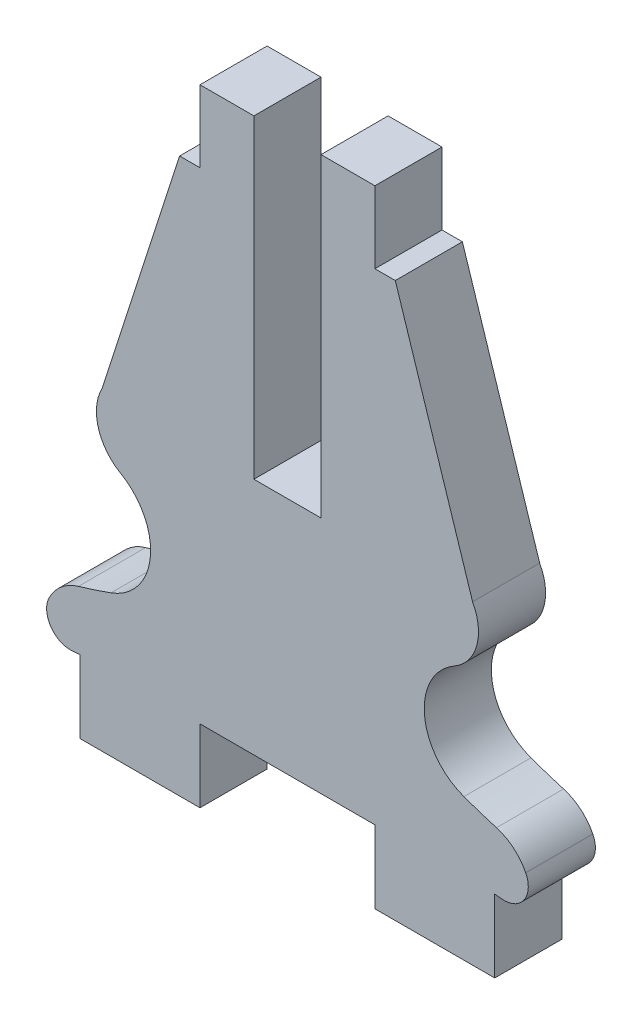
ISO-10303-21;
HEADER;
FILE_DESCRIPTION(('STEP AP214'),'2;1');
FILE_NAME('part.step','',(''),(''),'','','');
FILE_SCHEMA(('AUTOMOTIVE_DESIGN { 1 0 10303 214 1 1 1 1 }'));
ENDSEC;
DATA;
#1=APPLICATION_CONTEXT('core data for automotive mechanical design processes');
#2=APPLICATION_PROTOCOL_DEFINITION('international standard','automotive_design',2000,#1);
#3=PRODUCT_CONTEXT('',#1,'mechanical');
#4=PRODUCT('Part','Part','',(#3));
#5=PRODUCT_RELATED_PRODUCT_CATEGORY('part','',(#4));
#6=PRODUCT_DEFINITION_FORMATION('','',#4);
#7=PRODUCT_DEFINITION_CONTEXT('part definition',#1,'design');
#8=PRODUCT_DEFINITION('design','',#6,#7);
#9=PRODUCT_DEFINITION_SHAPE('','',#8);
#10=(LENGTH_UNIT() NAMED_UNIT(*) SI_UNIT(.MILLI.,.METRE.));
#11=(NAMED_UNIT(*) PLANE_ANGLE_UNIT() SI_UNIT($,.RADIAN.));
#12=(NAMED_UNIT(*) SI_UNIT($,.STERADIAN.) SOLID_ANGLE_UNIT());
#13=UNCERTAINTY_MEASURE_WITH_UNIT(LENGTH_MEASURE(1.E-05),#10,'distance_accuracy_value','');
#14=(GEOMETRIC_REPRESENTATION_CONTEXT(3) GLOBAL_UNCERTAINTY_ASSIGNED_CONTEXT((#13)) GLOBAL_UNIT_ASSIGNED_CONTEXT((#10,
#11,#12)) REPRESENTATION_CONTEXT('',''));
#15=CARTESIAN_POINT('',(0.,0.,0.));
#16=DIRECTION('',(0.,0.,1.));
#17=DIRECTION('',(1.,0.,0.));
#18=AXIS2_PLACEMENT_3D('',#15,#16,#17);
#19=CARTESIAN_POINT('',(-3.65,-3.,2.8));
#20=DIRECTION('',(0.,1.,0.));
#21=DIRECTION('',(0.,0.,1.));
#22=AXIS2_PLACEMENT_3D('',#19,#20,#21);
#23=PLANE('',#22);
#24=DIRECTION('',(1.,0.,0.));
#25=VECTOR('',#24,1.);
#26=CARTESIAN_POINT('',(-3.65,-3.,0.));
#27=LINE('',#26,#25);
#28=CARTESIAN_POINT('',(-8.65,-3.,0.));
#29=VERTEX_POINT('',#28);
#30=CARTESIAN_POINT('',(-3.65,-3.,0.));
#31=VERTEX_POINT('',#30);
#32=EDGE_CURVE('E276',#29,#31,#27,.T.);
#33=ORIENTED_EDGE('',*,*,#32,.T.);
#34=DIRECTION('',(0.,0.,-1.));
#35=VECTOR('',#34,1.);
#36=CARTESIAN_POINT('',(-3.65,-3.,2.8));
#37=LINE('',#36,#35);
#38=CARTESIAN_POINT('',(-3.65,-3.,2.8));
#39=VERTEX_POINT('',#38);
#40=EDGE_CURVE('E11',#39,#31,#37,.T.);
#41=ORIENTED_EDGE('',*,*,#40,.F.);
#42=DIRECTION('',(1.,0.,0.));
#43=VECTOR('',#42,1.);
#44=CARTESIAN_POINT('',(-3.65,-3.,2.8));
#45=LINE('',#44,#43);
#46=CARTESIAN_POINT('',(-8.65,-3.,2.8));
#47=VERTEX_POINT('',#46);
#48=EDGE_CURVE('E364',#47,#39,#45,.T.);
#49=ORIENTED_EDGE('',*,*,#48,.F.);
#50=DIRECTION('',(0.,0.,-1.));
#51=VECTOR('',#50,1.);
#52=CARTESIAN_POINT('',(-8.65,-3.,2.8));
#53=LINE('',#52,#51);
#54=EDGE_CURVE('E272',#47,#29,#53,.T.);
#55=ORIENTED_EDGE('',*,*,#54,.T.);
#56=EDGE_LOOP('',(#33,#41,#49,#55));
#57=FACE_BOUND('',#56,.T.);
#58=ADVANCED_FACE('F43',(#57),#23,.F.);
#59=CARTESIAN_POINT('',(-3.65,0.0356349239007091,2.8));
#60=DIRECTION('',(-1.,0.,0.));
#61=DIRECTION('',(0.,-1.,0.));
#62=AXIS2_PLACEMENT_3D('',#59,#60,#61);
#63=PLANE('',#62);
#64=DIRECTION('',(0.,1.,0.));
#65=VECTOR('',#64,1.);
#66=CARTESIAN_POINT('',(-3.65,0.0356349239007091,0.));
#67=LINE('',#66,#65);
#68=CARTESIAN_POINT('',(-3.65,0.0356349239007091,0.));
#69=VERTEX_POINT('',#68);
#70=EDGE_CURVE('E280',#31,#69,#67,.T.);
#71=ORIENTED_EDGE('',*,*,#70,.T.);
#72=DIRECTION('',(0.,0.,-1.));
#73=VECTOR('',#72,1.);
#74=CARTESIAN_POINT('',(-3.65,0.0356349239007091,2.8));
#75=LINE('',#74,#73);
#76=CARTESIAN_POINT('',(-3.65,0.0356349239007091,2.8));
#77=VERTEX_POINT('',#76);
#78=EDGE_CURVE('E52',#77,#69,#75,.T.);
#79=ORIENTED_EDGE('',*,*,#78,.F.);
#80=DIRECTION('',(0.,1.,0.));
#81=VECTOR('',#80,1.);
#82=CARTESIAN_POINT('',(-3.65,0.0356349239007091,2.8));
#83=LINE('',#82,#81);
#84=EDGE_CURVE('E169',#39,#77,#83,.T.);
#85=ORIENTED_EDGE('',*,*,#84,.F.);
#86=ORIENTED_EDGE('',*,*,#40,.T.);
#87=EDGE_LOOP('',(#71,#79,#85,#86));
#88=FACE_BOUND('',#87,.T.);
#89=ADVANCED_FACE('F584',(#88),#63,.F.);
#90=CARTESIAN_POINT('',(-3.65,0.0356349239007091,2.8));
#91=DIRECTION('',(0.,1.,0.));
#92=DIRECTION('',(0.,0.,1.));
#93=AXIS2_PLACEMENT_3D('',#90,#91,#92);
#94=PLANE('',#93);
#95=DIRECTION('',(1.,0.,0.));
#96=VECTOR('',#95,1.);
#97=CARTESIAN_POINT('',(-3.65,0.0356349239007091,0.));
#98=LINE('',#97,#96);
#99=CARTESIAN_POINT('',(3.65,0.0356349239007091,0.));
#100=VERTEX_POINT('',#99);
#101=EDGE_CURVE('E283',#69,#100,#98,.T.);
#102=ORIENTED_EDGE('',*,*,#101,.T.);
#103=DIRECTION('',(0.,0.,-1.));
#104=VECTOR('',#103,1.);
#105=CARTESIAN_POINT('',(3.65,0.0356349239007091,2.8));
#106=LINE('',#105,#104);
#107=CARTESIAN_POINT('',(3.65,0.0356349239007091,2.8));
#108=VERTEX_POINT('',#107);
#109=EDGE_CURVE('E463',#108,#100,#106,.T.);
#110=ORIENTED_EDGE('',*,*,#109,.F.);
#111=DIRECTION('',(1.,0.,0.));
#112=VECTOR('',#111,1.);
#113=CARTESIAN_POINT('',(-3.65,0.0356349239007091,2.8));
#114=LINE('',#113,#112);
#115=EDGE_CURVE('E473',#77,#108,#114,.T.);
#116=ORIENTED_EDGE('',*,*,#115,.F.);
#117=ORIENTED_EDGE('',*,*,#78,.T.);
#118=EDGE_LOOP('',(#102,#110,#116,#117));
#119=FACE_BOUND('',#118,.T.);
#120=ADVANCED_FACE('F471',(#119),#94,.F.);
#121=CARTESIAN_POINT('',(3.65,0.0356349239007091,2.8));
#122=DIRECTION('',(1.,0.,0.));
#123=DIRECTION('',(0.,1.,0.));
#124=AXIS2_PLACEMENT_3D('',#121,#122,#123);
#125=PLANE('',#124);
#126=DIRECTION('',(0.,-1.,0.));
#127=VECTOR('',#126,1.);
#128=CARTESIAN_POINT('',(3.65,0.0356349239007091,0.));
#129=LINE('',#128,#127);
#130=CARTESIAN_POINT('',(3.65,-2.99999999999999,0.));
#131=VERTEX_POINT('',#130);
#132=EDGE_CURVE('E286',#100,#131,#129,.T.);
#133=ORIENTED_EDGE('',*,*,#132,.T.);
#134=DIRECTION('',(0.,0.,-1.));
#135=VECTOR('',#134,1.);
#136=CARTESIAN_POINT('',(3.65,-2.99999999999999,2.8));
#137=LINE('',#136,#135);
#138=CARTESIAN_POINT('',(3.65,-2.99999999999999,2.8));
#139=VERTEX_POINT('',#138);
#140=EDGE_CURVE('E459',#139,#131,#137,.T.);
#141=ORIENTED_EDGE('',*,*,#140,.F.);
#142=DIRECTION('',(0.,-1.,0.));
#143=VECTOR('',#142,1.);
#144=CARTESIAN_POINT('',(3.65,0.0356349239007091,2.8));
#145=LINE('',#144,#143);
#146=EDGE_CURVE('E492',#108,#139,#145,.T.);
#147=ORIENTED_EDGE('',*,*,#146,.F.);
#148=ORIENTED_EDGE('',*,*,#109,.T.);
#149=EDGE_LOOP('',(#133,#141,#147,#148));
#150=FACE_BOUND('',#149,.T.);
#151=ADVANCED_FACE('F482',(#150),#125,.F.);
#152=CARTESIAN_POINT('',(3.65,-2.99999999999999,2.8));
#153=DIRECTION('',(0.,1.,0.));
#154=DIRECTION('',(-1.,0.,0.));
#155=AXIS2_PLACEMENT_3D('',#152,#153,#154);
#156=PLANE('',#155);
#157=DIRECTION('',(1.,0.,0.));
#158=VECTOR('',#157,1.);
#159=CARTESIAN_POINT('',(3.65,-2.99999999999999,0.));
#160=LINE('',#159,#158);
#161=CARTESIAN_POINT('',(8.65,-2.99999999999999,0.));
#162=VERTEX_POINT('',#161);
#163=EDGE_CURVE('E289',#131,#162,#160,.T.);
#164=ORIENTED_EDGE('',*,*,#163,.T.);
#165=DIRECTION('',(0.,0.,-1.));
#166=VECTOR('',#165,1.);
#167=CARTESIAN_POINT('',(8.65,-2.99999999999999,2.8));
#168=LINE('',#167,#166);
#169=CARTESIAN_POINT('',(8.65,-2.99999999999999,2.8));
#170=VERTEX_POINT('',#169);
#171=EDGE_CURVE('E455',#170,#162,#168,.T.);
#172=ORIENTED_EDGE('',*,*,#171,.F.);
#173=DIRECTION('',(1.,0.,0.));
#174=VECTOR('',#173,1.);
#175=CARTESIAN_POINT('',(3.65,-2.99999999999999,2.8));
#176=LINE('',#175,#174);
#177=EDGE_CURVE('E488',#139,#170,#176,.T.);
#178=ORIENTED_EDGE('',*,*,#177,.F.);
#179=ORIENTED_EDGE('',*,*,#140,.T.);
#180=EDGE_LOOP('',(#164,#172,#178,#179));
#181=FACE_BOUND('',#180,.T.);
#182=ADVANCED_FACE('F486',(#181),#156,.F.);
#183=CARTESIAN_POINT('',(8.65,-2.99999999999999,2.8));
#184=DIRECTION('',(-1.,0.,0.));
#185=DIRECTION('',(0.,-1.,0.));
#186=AXIS2_PLACEMENT_3D('',#183,#184,#185);
#187=PLANE('',#186);
#188=DIRECTION('',(0.,1.,0.));
#189=VECTOR('',#188,1.);
#190=CARTESIAN_POINT('',(8.65,-2.99999999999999,0.));
#191=LINE('',#190,#189);
#192=CARTESIAN_POINT('',(8.65,0.0356349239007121,0.));
#193=VERTEX_POINT('',#192);
#194=EDGE_CURVE('E292',#162,#193,#191,.T.);
#195=ORIENTED_EDGE('',*,*,#194,.T.);
#196=DIRECTION('',(0.,0.,-1.));
#197=VECTOR('',#196,1.);
#198=CARTESIAN_POINT('',(8.65,0.0356349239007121,2.8));
#199=LINE('',#198,#197);
#200=CARTESIAN_POINT('',(8.65,0.0356349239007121,2.8));
#201=VERTEX_POINT('',#200);
#202=EDGE_CURVE('E451',#201,#193,#199,.T.);
#203=ORIENTED_EDGE('',*,*,#202,.F.);
#204=DIRECTION('',(0.,1.,0.));
#205=VECTOR('',#204,1.);
#206=CARTESIAN_POINT('',(8.65,-2.99999999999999,2.8));
#207=LINE('',#206,#205);
#208=EDGE_CURVE('E491',#170,#201,#207,.T.);
#209=ORIENTED_EDGE('',*,*,#208,.F.);
#210=ORIENTED_EDGE('',*,*,#171,.T.);
#211=EDGE_LOOP('',(#195,#203,#209,#210));
#212=FACE_BOUND('',#211,.T.);
#213=ADVANCED_FACE('F597',(#212),#187,.F.);
#214=CARTESIAN_POINT('',(8.65,0.0356349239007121,2.8));
#215=DIRECTION('',(0.10155089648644,0.994830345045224,0.));
#216=DIRECTION('',(-0.994830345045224,0.10155089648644,0.));
#217=AXIS2_PLACEMENT_3D('',#214,#215,#216);
#218=PLANE('',#217);
#219=DIRECTION('',(0.994830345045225,-0.10155089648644,0.));
#220=VECTOR('',#219,1.);
#221=CARTESIAN_POINT('',(8.65,0.0356349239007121,0.));
#222=LINE('',#221,#220);
#223=CARTESIAN_POINT('',(8.94844910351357,0.00516965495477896,0.));
#224=VERTEX_POINT('',#223);
#225=EDGE_CURVE('E295',#193,#224,#222,.T.);
#226=ORIENTED_EDGE('',*,*,#225,.T.);
#227=DIRECTION('',(0.,0.,-1.));
#228=VECTOR('',#227,1.);
#229=CARTESIAN_POINT('',(8.94844910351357,0.00516965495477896,2.8));
#230=LINE('',#229,#228);
#231=CARTESIAN_POINT('',(8.94844910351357,0.00516965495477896,2.8));
#232=VERTEX_POINT('',#231);
#233=EDGE_CURVE('E447',#232,#224,#230,.T.);
#234=ORIENTED_EDGE('',*,*,#233,.F.);
#235=DIRECTION('',(0.994830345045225,-0.10155089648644,0.));
#236=VECTOR('',#235,1.);
#237=CARTESIAN_POINT('',(8.65,0.0356349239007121,2.8));
#238=LINE('',#237,#236);
#239=EDGE_CURVE('E496',#201,#232,#238,.T.);
#240=ORIENTED_EDGE('',*,*,#239,.F.);
#241=ORIENTED_EDGE('',*,*,#202,.T.);
#242=EDGE_LOOP('',(#226,#234,#240,#241));
#243=FACE_BOUND('',#242,.T.);
#244=ADVANCED_FACE('F600',(#243),#218,.F.);
#245=CARTESIAN_POINT('',(9.05,1.,2.8));
#246=DIRECTION('',(0.,0.,-1.));
#247=DIRECTION('',(-1.,0.,0.));
#248=AXIS2_PLACEMENT_3D('',#245,#246,#247);
#249=CYLINDRICAL_SURFACE('',#248,1.);
#250=CARTESIAN_POINT('',(9.05,1.,0.));
#251=DIRECTION('',(0.,0.,1.));
#252=DIRECTION('',(1.,0.,0.));
#253=AXIS2_PLACEMENT_3D('',#250,#251,#252);
#254=CIRCLE('',#253,1.);
#255=CARTESIAN_POINT('',(9.94310679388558,1.44984470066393,0.));
#256=VERTEX_POINT('',#255);
#257=EDGE_CURVE('E298',#224,#256,#254,.T.);
#258=ORIENTED_EDGE('',*,*,#257,.T.);
#259=DIRECTION('',(0.,0.,-1.));
#260=VECTOR('',#259,1.);
#261=CARTESIAN_POINT('',(9.94310679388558,1.44984470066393,2.8));
#262=LINE('',#261,#260);
#263=CARTESIAN_POINT('',(9.94310679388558,1.44984470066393,2.8));
#264=VERTEX_POINT('',#263);
#265=EDGE_CURVE('E443',#264,#256,#262,.T.);
#266=ORIENTED_EDGE('',*,*,#265,.F.);
#267=CARTESIAN_POINT('',(9.05,1.,2.8));
#268=DIRECTION('',(0.,0.,1.));
#269=DIRECTION('',(1.,0.,0.));
#270=AXIS2_PLACEMENT_3D('',#267,#268,#269);
#271=CIRCLE('',#270,1.);
#272=EDGE_CURVE('E503',#232,#264,#271,.T.);
#273=ORIENTED_EDGE('',*,*,#272,.F.);
#274=ORIENTED_EDGE('',*,*,#233,.T.);
#275=EDGE_LOOP('',(#258,#266,#273,#274));
#276=FACE_BOUND('',#275,.T.);
#277=ADVANCED_FACE('F604',(#276),#249,.T.);
#278=CARTESIAN_POINT('',(8.15689320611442,0.550155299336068,2.8));
#279=DIRECTION('',(0.,0.,-1.));
#280=DIRECTION('',(-1.,0.,0.));
#281=AXIS2_PLACEMENT_3D('',#278,#279,#280);
#282=CYLINDRICAL_SURFACE('',#281,2.);
#283=CARTESIAN_POINT('',(8.15689320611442,0.550155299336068,0.));
#284=DIRECTION('',(0.,0.,1.));
#285=DIRECTION('',(1.,0.,0.));
#286=AXIS2_PLACEMENT_3D('',#283,#284,#285);
#287=CIRCLE('',#286,2.);
#288=CARTESIAN_POINT('',(8.72257182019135,2.46848991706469,0.));
#289=VERTEX_POINT('',#288);
#290=EDGE_CURVE('E301',#256,#289,#287,.T.);
#291=ORIENTED_EDGE('',*,*,#290,.T.);
#292=DIRECTION('',(0.,0.,-1.));
#293=VECTOR('',#292,1.);
#294=CARTESIAN_POINT('',(8.72257182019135,2.46848991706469,2.8));
#295=LINE('',#294,#293);
#296=CARTESIAN_POINT('',(8.72257182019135,2.46848991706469,2.8));
#297=VERTEX_POINT('',#296);
#298=EDGE_CURVE('E439',#297,#289,#295,.T.);
#299=ORIENTED_EDGE('',*,*,#298,.F.);
#300=CARTESIAN_POINT('',(8.15689320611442,0.550155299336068,2.8));
#301=DIRECTION('',(0.,0.,1.));
#302=DIRECTION('',(1.,0.,0.));
#303=AXIS2_PLACEMENT_3D('',#300,#301,#302);
#304=CIRCLE('',#303,2.);
#305=EDGE_CURVE('E506',#264,#297,#304,.T.);
#306=ORIENTED_EDGE('',*,*,#305,.F.);
#307=ORIENTED_EDGE('',*,*,#265,.T.);
#308=EDGE_LOOP('',(#291,#299,#306,#307));
#309=FACE_BOUND('',#308,.T.);
#310=ADVANCED_FACE('F608',(#309),#282,.T.);
#311=CARTESIAN_POINT('',(15.6391267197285,25.9239757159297,2.8));
#312=DIRECTION('',(0.,0.,-1.));
#313=DIRECTION('',(-1.,0.,0.));
#314=AXIS2_PLACEMENT_3D('',#311,#312,#313);
#315=CYLINDRICAL_SURFACE('',#314,24.4540087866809);
#316=CARTESIAN_POINT('',(15.6391267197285,25.9239757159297,0.));
#317=DIRECTION('',(0.,0.,-1.));
#318=DIRECTION('',(-1.,0.,0.));
#319=AXIS2_PLACEMENT_3D('',#316,#317,#318);
#320=CIRCLE('',#319,24.4540087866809);
#321=CARTESIAN_POINT('',(7.36246639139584,2.91320781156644,0.));
#322=VERTEX_POINT('',#321);
#323=EDGE_CURVE('E304',#289,#322,#320,.T.);
#324=ORIENTED_EDGE('',*,*,#323,.T.);
#325=DIRECTION('',(0.,0.,-1.));
#326=VECTOR('',#325,1.);
#327=CARTESIAN_POINT('',(7.36246639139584,2.91320781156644,2.8));
#328=LINE('',#327,#326);
#329=CARTESIAN_POINT('',(7.36246639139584,2.91320781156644,2.8));
#330=VERTEX_POINT('',#329);
#331=EDGE_CURVE('E435',#330,#322,#328,.T.);
#332=ORIENTED_EDGE('',*,*,#331,.F.);
#333=CARTESIAN_POINT('',(15.6391267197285,25.9239757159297,2.8));
#334=DIRECTION('',(0.,0.,-1.));
#335=DIRECTION('',(-1.,0.,0.));
#336=AXIS2_PLACEMENT_3D('',#333,#334,#335);
#337=CIRCLE('',#336,24.4540087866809);
#338=EDGE_CURVE('E509',#297,#330,#337,.T.);
#339=ORIENTED_EDGE('',*,*,#338,.F.);
#340=ORIENTED_EDGE('',*,*,#298,.T.);
#341=EDGE_LOOP('',(#324,#332,#339,#340));
#342=FACE_BOUND('',#341,.T.);
#343=ADVANCED_FACE('F612',(#342),#315,.F.);
#344=CARTESIAN_POINT('',(8.20861194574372,5.26566136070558,2.8));
#345=DIRECTION('',(0.,0.,-1.));
#346=DIRECTION('',(-1.,0.,0.));
#347=AXIS2_PLACEMENT_3D('',#344,#345,#346);
#348=CYLINDRICAL_SURFACE('',#347,2.5);
#349=CARTESIAN_POINT('',(8.20861194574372,5.26566136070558,0.));
#350=DIRECTION('',(0.,0.,-1.));
#351=DIRECTION('',(-1.,0.,0.));
#352=AXIS2_PLACEMENT_3D('',#349,#350,#351);
#353=CIRCLE('',#352,2.5);
#354=CARTESIAN_POINT('',(6.96635920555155,7.43517930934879,0.));
#355=VERTEX_POINT('',#354);
#356=EDGE_CURVE('E307',#322,#355,#353,.T.);
#357=ORIENTED_EDGE('',*,*,#356,.T.);
#358=DIRECTION('',(0.,0.,-1.));
#359=VECTOR('',#358,1.);
#360=CARTESIAN_POINT('',(6.96635920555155,7.43517930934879,2.8));
#361=LINE('',#360,#359);
#362=CARTESIAN_POINT('',(6.96635920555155,7.43517930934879,2.8));
#363=VERTEX_POINT('',#362);
#364=EDGE_CURVE('E431',#363,#355,#361,.T.);
#365=ORIENTED_EDGE('',*,*,#364,.F.);
#366=CARTESIAN_POINT('',(8.20861194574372,5.26566136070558,2.8));
#367=DIRECTION('',(0.,0.,-1.));
#368=DIRECTION('',(-1.,0.,0.));
#369=AXIS2_PLACEMENT_3D('',#366,#367,#368);
#370=CIRCLE('',#369,2.5);
#371=EDGE_CURVE('E512',#330,#363,#370,.T.);
#372=ORIENTED_EDGE('',*,*,#371,.F.);
#373=ORIENTED_EDGE('',*,*,#331,.T.);
#374=EDGE_LOOP('',(#357,#365,#372,#373));
#375=FACE_BOUND('',#374,.T.);
#376=ADVANCED_FACE('F616',(#375),#348,.F.);
#377=CARTESIAN_POINT('',(5.97255701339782,9.17079366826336,2.8));
#378=DIRECTION('',(0.,0.,-1.));
#379=DIRECTION('',(-1.,0.,0.));
#380=AXIS2_PLACEMENT_3D('',#377,#378,#379);
#381=CYLINDRICAL_SURFACE('',#380,2.);
#382=CARTESIAN_POINT('',(5.97255701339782,9.17079366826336,0.));
#383=DIRECTION('',(0.,0.,1.));
#384=DIRECTION('',(1.,0.,0.));
#385=AXIS2_PLACEMENT_3D('',#382,#383,#384);
#386=CIRCLE('',#385,2.);
#387=CARTESIAN_POINT('',(7.72650027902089,10.1318779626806,0.));
#388=VERTEX_POINT('',#387);
#389=EDGE_CURVE('E310',#355,#388,#386,.T.);
#390=ORIENTED_EDGE('',*,*,#389,.T.);
#391=DIRECTION('',(0.,0.,-1.));
#392=VECTOR('',#391,1.);
#393=CARTESIAN_POINT('',(7.72650027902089,10.1318779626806,2.8));
#394=LINE('',#393,#392);
#395=CARTESIAN_POINT('',(7.72650027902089,10.1318779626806,2.8));
#396=VERTEX_POINT('',#395);
#397=EDGE_CURVE('E427',#396,#388,#394,.T.);
#398=ORIENTED_EDGE('',*,*,#397,.F.);
#399=CARTESIAN_POINT('',(5.97255701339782,9.17079366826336,2.8));
#400=DIRECTION('',(0.,0.,1.));
#401=DIRECTION('',(1.,0.,0.));
#402=AXIS2_PLACEMENT_3D('',#399,#400,#401);
#403=CIRCLE('',#402,2.);
#404=EDGE_CURVE('E515',#363,#396,#403,.T.);
#405=ORIENTED_EDGE('',*,*,#404,.F.);
#406=ORIENTED_EDGE('',*,*,#364,.T.);
#407=EDGE_LOOP('',(#390,#398,#405,#406));
#408=FACE_BOUND('',#407,.T.);
#409=ADVANCED_FACE('F620',(#408),#381,.T.);
#410=CARTESIAN_POINT('',(7.72650027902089,10.1318779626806,2.8));
#411=DIRECTION('',(-0.951689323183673,-0.307062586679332,0.));
#412=DIRECTION('',(0.307062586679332,-0.951689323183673,0.));
#413=AXIS2_PLACEMENT_3D('',#410,#411,#412);
#414=PLANE('',#413);
#415=DIRECTION('',(-0.307062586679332,0.951689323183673,0.));
#416=VECTOR('',#415,1.);
#417=CARTESIAN_POINT('',(7.72650027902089,10.1318779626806,0.));
#418=LINE('',#417,#416);
#419=CARTESIAN_POINT('',(4.5,20.1318779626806,0.));
#420=VERTEX_POINT('',#419);
#421=EDGE_CURVE('E313',#388,#420,#418,.T.);
#422=ORIENTED_EDGE('',*,*,#421,.T.);
#423=DIRECTION('',(0.,0.,-1.));
#424=VECTOR('',#423,1.);
#425=CARTESIAN_POINT('',(4.5,20.1318779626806,2.8));
#426=LINE('',#425,#424);
#427=CARTESIAN_POINT('',(4.5,20.1318779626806,2.8));
#428=VERTEX_POINT('',#427);
#429=EDGE_CURVE('E423',#428,#420,#426,.T.);
#430=ORIENTED_EDGE('',*,*,#429,.F.);
#431=DIRECTION('',(-0.307062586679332,0.951689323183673,0.));
#432=VECTOR('',#431,1.);
#433=CARTESIAN_POINT('',(7.72650027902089,10.1318779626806,2.8));
#434=LINE('',#433,#432);
#435=EDGE_CURVE('E518',#396,#428,#434,.T.);
#436=ORIENTED_EDGE('',*,*,#435,.F.);
#437=ORIENTED_EDGE('',*,*,#397,.T.);
#438=EDGE_LOOP('',(#422,#430,#436,#437));
#439=FACE_BOUND('',#438,.T.);
#440=ADVANCED_FACE('F624',(#439),#414,.F.);
#441=CARTESIAN_POINT('',(3.65,20.1318779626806,2.8));
#442=DIRECTION('',(0.,-1.,0.));
#443=DIRECTION('',(1.,0.,0.));
#444=AXIS2_PLACEMENT_3D('',#441,#442,#443);
#445=PLANE('',#444);
#446=DIRECTION('',(-1.,0.,0.));
#447=VECTOR('',#446,1.);
#448=CARTESIAN_POINT('',(3.65,20.1318779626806,0.));
#449=LINE('',#448,#447);
#450=CARTESIAN_POINT('',(3.65,20.1318779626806,0.));
#451=VERTEX_POINT('',#450);
#452=EDGE_CURVE('E316',#420,#451,#449,.T.);
#453=ORIENTED_EDGE('',*,*,#452,.T.);
#454=DIRECTION('',(0.,0.,-1.));
#455=VECTOR('',#454,1.);
#456=CARTESIAN_POINT('',(3.65,20.1318779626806,2.8));
#457=LINE('',#456,#455);
#458=CARTESIAN_POINT('',(3.65,20.1318779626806,2.8));
#459=VERTEX_POINT('',#458);
#460=EDGE_CURVE('E419',#459,#451,#457,.T.);
#461=ORIENTED_EDGE('',*,*,#460,.F.);
#462=DIRECTION('',(-1.,0.,0.));
#463=VECTOR('',#462,1.);
#464=CARTESIAN_POINT('',(3.65,20.1318779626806,2.8));
#465=LINE('',#464,#463);
#466=EDGE_CURVE('E521',#428,#459,#465,.T.);
#467=ORIENTED_EDGE('',*,*,#466,.F.);
#468=ORIENTED_EDGE('',*,*,#429,.T.);
#469=EDGE_LOOP('',(#453,#461,#467,#468));
#470=FACE_BOUND('',#469,.T.);
#471=ADVANCED_FACE('F628',(#470),#445,.F.);
#472=CARTESIAN_POINT('',(3.65,23.1318779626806,2.8));
#473=DIRECTION('',(-1.,0.,0.));
#474=DIRECTION('',(0.,-1.,0.));
#475=AXIS2_PLACEMENT_3D('',#472,#473,#474);
#476=PLANE('',#475);
#477=DIRECTION('',(0.,1.,0.));
#478=VECTOR('',#477,1.);
#479=CARTESIAN_POINT('',(3.65,23.1318779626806,0.));
#480=LINE('',#479,#478);
#481=CARTESIAN_POINT('',(3.65,23.1318779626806,0.));
#482=VERTEX_POINT('',#481);
#483=EDGE_CURVE('E319',#451,#482,#480,.T.);
#484=ORIENTED_EDGE('',*,*,#483,.T.);
#485=DIRECTION('',(0.,0.,-1.));
#486=VECTOR('',#485,1.);
#487=CARTESIAN_POINT('',(3.65,23.1318779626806,2.8));
#488=LINE('',#487,#486);
#489=CARTESIAN_POINT('',(3.65,23.1318779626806,2.8));
#490=VERTEX_POINT('',#489);
#491=EDGE_CURVE('E415',#490,#482,#488,.T.);
#492=ORIENTED_EDGE('',*,*,#491,.F.);
#493=DIRECTION('',(0.,1.,0.));
#494=VECTOR('',#493,1.);
#495=CARTESIAN_POINT('',(3.65,23.1318779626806,2.8));
#496=LINE('',#495,#494);
#497=EDGE_CURVE('E524',#459,#490,#496,.T.);
#498=ORIENTED_EDGE('',*,*,#497,.F.);
#499=ORIENTED_EDGE('',*,*,#460,.T.);
#500=EDGE_LOOP('',(#484,#492,#498,#499));
#501=FACE_BOUND('',#500,.T.);
#502=ADVANCED_FACE('F632',(#501),#476,.F.);
#503=CARTESIAN_POINT('',(1.4,23.1318779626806,2.8));
#504=DIRECTION('',(0.,-1.,0.));
#505=DIRECTION('',(0.,0.,-1.));
#506=AXIS2_PLACEMENT_3D('',#503,#504,#505);
#507=PLANE('',#506);
#508=DIRECTION('',(-1.,0.,0.));
#509=VECTOR('',#508,1.);
#510=CARTESIAN_POINT('',(1.4,23.1318779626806,0.));
#511=LINE('',#510,#509);
#512=CARTESIAN_POINT('',(1.4,23.1318779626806,0.));
#513=VERTEX_POINT('',#512);
#514=EDGE_CURVE('E322',#482,#513,#511,.T.);
#515=ORIENTED_EDGE('',*,*,#514,.T.);
#516=DIRECTION('',(0.,0.,-1.));
#517=VECTOR('',#516,1.);
#518=CARTESIAN_POINT('',(1.4,23.1318779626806,2.8));
#519=LINE('',#518,#517);
#520=CARTESIAN_POINT('',(1.4,23.1318779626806,2.8));
#521=VERTEX_POINT('',#520);
#522=EDGE_CURVE('E411',#521,#513,#519,.T.);
#523=ORIENTED_EDGE('',*,*,#522,.F.);
#524=DIRECTION('',(-1.,0.,0.));
#525=VECTOR('',#524,1.);
#526=CARTESIAN_POINT('',(1.4,23.1318779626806,2.8));
#527=LINE('',#526,#525);
#528=EDGE_CURVE('E527',#490,#521,#527,.T.);
#529=ORIENTED_EDGE('',*,*,#528,.F.);
#530=ORIENTED_EDGE('',*,*,#491,.T.);
#531=EDGE_LOOP('',(#515,#523,#529,#530));
#532=FACE_BOUND('',#531,.T.);
#533=ADVANCED_FACE('F636',(#532),#507,.F.);
#534=CARTESIAN_POINT('',(1.4,10.,2.8));
#535=DIRECTION('',(1.,0.,0.));
#536=DIRECTION('',(0.,0.,-1.));
#537=AXIS2_PLACEMENT_3D('',#534,#535,#536);
#538=PLANE('',#537);
#539=DIRECTION('',(0.,-1.,0.));
#540=VECTOR('',#539,1.);
#541=CARTESIAN_POINT('',(1.4,10.,0.));
#542=LINE('',#541,#540);
#543=CARTESIAN_POINT('',(1.4,10.,0.));
#544=VERTEX_POINT('',#543);
#545=EDGE_CURVE('E325',#513,#544,#542,.T.);
#546=ORIENTED_EDGE('',*,*,#545,.T.);
#547=DIRECTION('',(0.,0.,-1.));
#548=VECTOR('',#547,1.);
#549=CARTESIAN_POINT('',(1.4,10.,2.8));
#550=LINE('',#549,#548);
#551=CARTESIAN_POINT('',(1.4,10.,2.8));
#552=VERTEX_POINT('',#551);
#553=EDGE_CURVE('E407',#552,#544,#550,.T.);
#554=ORIENTED_EDGE('',*,*,#553,.F.);
#555=DIRECTION('',(0.,-1.,0.));
#556=VECTOR('',#555,1.);
#557=CARTESIAN_POINT('',(1.4,10.,2.8));
#558=LINE('',#557,#556);
#559=EDGE_CURVE('E530',#521,#552,#558,.T.);
#560=ORIENTED_EDGE('',*,*,#559,.F.);
#561=ORIENTED_EDGE('',*,*,#522,.T.);
#562=EDGE_LOOP('',(#546,#554,#560,#561));
#563=FACE_BOUND('',#562,.T.);
#564=ADVANCED_FACE('F640',(#563),#538,.F.);
#565=CARTESIAN_POINT('',(-1.4,10.,2.8));
#566=DIRECTION('',(0.,-1.,0.));
#567=DIRECTION('',(0.,0.,-1.));
#568=AXIS2_PLACEMENT_3D('',#565,#566,#567);
#569=PLANE('',#568);
#570=DIRECTION('',(-1.,0.,0.));
#571=VECTOR('',#570,1.);
#572=CARTESIAN_POINT('',(-1.4,10.,0.));
#573=LINE('',#572,#571);
#574=CARTESIAN_POINT('',(-1.4,10.,0.));
#575=VERTEX_POINT('',#574);
#576=EDGE_CURVE('E328',#544,#575,#573,.T.);
#577=ORIENTED_EDGE('',*,*,#576,.T.);
#578=DIRECTION('',(0.,0.,-1.));
#579=VECTOR('',#578,1.);
#580=CARTESIAN_POINT('',(-1.4,10.,2.8));
#581=LINE('',#580,#579);
#582=CARTESIAN_POINT('',(-1.4,10.,2.8));
#583=VERTEX_POINT('',#582);
#584=EDGE_CURVE('E403',#583,#575,#581,.T.);
#585=ORIENTED_EDGE('',*,*,#584,.F.);
#586=DIRECTION('',(-1.,0.,0.));
#587=VECTOR('',#586,1.);
#588=CARTESIAN_POINT('',(-1.4,10.,2.8));
#589=LINE('',#588,#587);
#590=EDGE_CURVE('E533',#552,#583,#589,.T.);
#591=ORIENTED_EDGE('',*,*,#590,.F.);
#592=ORIENTED_EDGE('',*,*,#553,.T.);
#593=EDGE_LOOP('',(#577,#585,#591,#592));
#594=FACE_BOUND('',#593,.T.);
#595=ADVANCED_FACE('F644',(#594),#569,.F.);
#596=CARTESIAN_POINT('',(-1.4,23.1318779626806,2.8));
#597=DIRECTION('',(-1.,0.,0.));
#598=DIRECTION('',(0.,0.,1.));
#599=AXIS2_PLACEMENT_3D('',#596,#597,#598);
#600=PLANE('',#599);
#601=DIRECTION('',(0.,1.,0.));
#602=VECTOR('',#601,1.);
#603=CARTESIAN_POINT('',(-1.4,23.1318779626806,0.));
#604=LINE('',#603,#602);
#605=CARTESIAN_POINT('',(-1.4,23.1318779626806,0.));
#606=VERTEX_POINT('',#605);
#607=EDGE_CURVE('E331',#575,#606,#604,.T.);
#608=ORIENTED_EDGE('',*,*,#607,.T.);
#609=DIRECTION('',(0.,0.,-1.));
#610=VECTOR('',#609,1.);
#611=CARTESIAN_POINT('',(-1.4,23.1318779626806,2.8));
#612=LINE('',#611,#610);
#613=CARTESIAN_POINT('',(-1.4,23.1318779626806,2.8));
#614=VERTEX_POINT('',#613);
#615=EDGE_CURVE('E399',#614,#606,#612,.T.);
#616=ORIENTED_EDGE('',*,*,#615,.F.);
#617=DIRECTION('',(0.,1.,0.));
#618=VECTOR('',#617,1.);
#619=CARTESIAN_POINT('',(-1.4,23.1318779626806,2.8));
#620=LINE('',#619,#618);
#621=EDGE_CURVE('E536',#583,#614,#620,.T.);
#622=ORIENTED_EDGE('',*,*,#621,.F.);
#623=ORIENTED_EDGE('',*,*,#584,.T.);
#624=EDGE_LOOP('',(#608,#616,#622,#623));
#625=FACE_BOUND('',#624,.T.);
#626=ADVANCED_FACE('F648',(#625),#600,.F.);
#627=CARTESIAN_POINT('',(-3.65,23.1318779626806,2.8));
#628=DIRECTION('',(0.,-1.,0.));
#629=DIRECTION('',(1.,0.,0.));
#630=AXIS2_PLACEMENT_3D('',#627,#628,#629);
#631=PLANE('',#630);
#632=DIRECTION('',(-1.,0.,0.));
#633=VECTOR('',#632,1.);
#634=CARTESIAN_POINT('',(-3.65,23.1318779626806,0.));
#635=LINE('',#634,#633);
#636=CARTESIAN_POINT('',(-3.65,23.1318779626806,0.));
#637=VERTEX_POINT('',#636);
#638=EDGE_CURVE('E334',#606,#637,#635,.T.);
#639=ORIENTED_EDGE('',*,*,#638,.T.);
#640=DIRECTION('',(0.,0.,-1.));
#641=VECTOR('',#640,1.);
#642=CARTESIAN_POINT('',(-3.65,23.1318779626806,2.8));
#643=LINE('',#642,#641);
#644=CARTESIAN_POINT('',(-3.65,23.1318779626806,2.8));
#645=VERTEX_POINT('',#644);
#646=EDGE_CURVE('E395',#645,#637,#643,.T.);
#647=ORIENTED_EDGE('',*,*,#646,.F.);
#648=DIRECTION('',(-1.,0.,0.));
#649=VECTOR('',#648,1.);
#650=CARTESIAN_POINT('',(-3.65,23.1318779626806,2.8));
#651=LINE('',#650,#649);
#652=EDGE_CURVE('E539',#614,#645,#651,.T.);
#653=ORIENTED_EDGE('',*,*,#652,.F.);
#654=ORIENTED_EDGE('',*,*,#615,.T.);
#655=EDGE_LOOP('',(#639,#647,#653,#654));
#656=FACE_BOUND('',#655,.T.);
#657=ADVANCED_FACE('F652',(#656),#631,.F.);
#658=CARTESIAN_POINT('',(-3.65,20.1318779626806,2.8));
#659=DIRECTION('',(1.,0.,0.));
#660=DIRECTION('',(0.,0.,-1.));
#661=AXIS2_PLACEMENT_3D('',#658,#659,#660);
#662=PLANE('',#661);
#663=DIRECTION('',(0.,-1.,0.));
#664=VECTOR('',#663,1.);
#665=CARTESIAN_POINT('',(-3.65,20.1318779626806,0.));
#666=LINE('',#665,#664);
#667=CARTESIAN_POINT('',(-3.65,20.1318779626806,0.));
#668=VERTEX_POINT('',#667);
#669=EDGE_CURVE('E337',#637,#668,#666,.T.);
#670=ORIENTED_EDGE('',*,*,#669,.T.);
#671=DIRECTION('',(0.,0.,-1.));
#672=VECTOR('',#671,1.);
#673=CARTESIAN_POINT('',(-3.65,20.1318779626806,2.8));
#674=LINE('',#673,#672);
#675=CARTESIAN_POINT('',(-3.65,20.1318779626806,2.8));
#676=VERTEX_POINT('',#675);
#677=EDGE_CURVE('E391',#676,#668,#674,.T.);
#678=ORIENTED_EDGE('',*,*,#677,.F.);
#679=DIRECTION('',(0.,-1.,0.));
#680=VECTOR('',#679,1.);
#681=CARTESIAN_POINT('',(-3.65,20.1318779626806,2.8));
#682=LINE('',#681,#680);
#683=EDGE_CURVE('E542',#645,#676,#682,.T.);
#684=ORIENTED_EDGE('',*,*,#683,.F.);
#685=ORIENTED_EDGE('',*,*,#646,.T.);
#686=EDGE_LOOP('',(#670,#678,#684,#685));
#687=FACE_BOUND('',#686,.T.);
#688=ADVANCED_FACE('F656',(#687),#662,.F.);
#689=CARTESIAN_POINT('',(-4.5,20.1318779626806,2.8));
#690=DIRECTION('',(0.,-1.,0.));
#691=DIRECTION('',(1.,0.,0.));
#692=AXIS2_PLACEMENT_3D('',#689,#690,#691);
#693=PLANE('',#692);
#694=DIRECTION('',(-1.,0.,0.));
#695=VECTOR('',#694,1.);
#696=CARTESIAN_POINT('',(-4.5,20.1318779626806,0.));
#697=LINE('',#696,#695);
#698=CARTESIAN_POINT('',(-4.5,20.1318779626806,0.));
#699=VERTEX_POINT('',#698);
#700=EDGE_CURVE('E340',#668,#699,#697,.T.);
#701=ORIENTED_EDGE('',*,*,#700,.T.);
#702=DIRECTION('',(0.,0.,-1.));
#703=VECTOR('',#702,1.);
#704=CARTESIAN_POINT('',(-4.5,20.1318779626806,2.8));
#705=LINE('',#704,#703);
#706=CARTESIAN_POINT('',(-4.5,20.1318779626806,2.8));
#707=VERTEX_POINT('',#706);
#708=EDGE_CURVE('E387',#707,#699,#705,.T.);
#709=ORIENTED_EDGE('',*,*,#708,.F.);
#710=DIRECTION('',(-1.,0.,0.));
#711=VECTOR('',#710,1.);
#712=CARTESIAN_POINT('',(-4.5,20.1318779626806,2.8));
#713=LINE('',#712,#711);
#714=EDGE_CURVE('E545',#676,#707,#713,.T.);
#715=ORIENTED_EDGE('',*,*,#714,.F.);
#716=ORIENTED_EDGE('',*,*,#677,.T.);
#717=EDGE_LOOP('',(#701,#709,#715,#716));
#718=FACE_BOUND('',#717,.T.);
#719=ADVANCED_FACE('F660',(#718),#693,.F.);
#720=CARTESIAN_POINT('',(-7.72650027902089,10.1318779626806,2.8));
#721=DIRECTION('',(0.951689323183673,-0.307062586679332,0.));
#722=DIRECTION('',(0.307062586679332,0.951689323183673,0.));
#723=AXIS2_PLACEMENT_3D('',#720,#721,#722);
#724=PLANE('',#723);
#725=DIRECTION('',(-0.307062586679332,-0.951689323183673,0.));
#726=VECTOR('',#725,1.);
#727=CARTESIAN_POINT('',(-7.72650027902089,10.1318779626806,0.));
#728=LINE('',#727,#726);
#729=CARTESIAN_POINT('',(-7.72650027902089,10.1318779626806,0.));
#730=VERTEX_POINT('',#729);
#731=EDGE_CURVE('E343',#699,#730,#728,.T.);
#732=ORIENTED_EDGE('',*,*,#731,.T.);
#733=DIRECTION('',(0.,0.,-1.));
#734=VECTOR('',#733,1.);
#735=CARTESIAN_POINT('',(-7.72650027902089,10.1318779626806,2.8));
#736=LINE('',#735,#734);
#737=CARTESIAN_POINT('',(-7.72650027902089,10.1318779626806,2.8));
#738=VERTEX_POINT('',#737);
#739=EDGE_CURVE('E383',#738,#730,#736,.T.);
#740=ORIENTED_EDGE('',*,*,#739,.F.);
#741=DIRECTION('',(-0.307062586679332,-0.951689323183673,0.));
#742=VECTOR('',#741,1.);
#743=CARTESIAN_POINT('',(-7.72650027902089,10.1318779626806,2.8));
#744=LINE('',#743,#742);
#745=EDGE_CURVE('E548',#707,#738,#744,.T.);
#746=ORIENTED_EDGE('',*,*,#745,.F.);
#747=ORIENTED_EDGE('',*,*,#708,.T.);
#748=EDGE_LOOP('',(#732,#740,#746,#747));
#749=FACE_BOUND('',#748,.T.);
#750=ADVANCED_FACE('F664',(#749),#724,.F.);
#751=CARTESIAN_POINT('',(-5.97255701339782,9.17079366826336,2.8));
#752=DIRECTION('',(0.,0.,-1.));
#753=DIRECTION('',(-1.,0.,0.));
#754=AXIS2_PLACEMENT_3D('',#751,#752,#753);
#755=CYLINDRICAL_SURFACE('',#754,2.);
#756=CARTESIAN_POINT('',(-5.97255701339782,9.17079366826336,0.));
#757=DIRECTION('',(0.,0.,1.));
#758=DIRECTION('',(-1.,0.,0.));
#759=AXIS2_PLACEMENT_3D('',#756,#757,#758);
#760=CIRCLE('',#759,2.);
#761=CARTESIAN_POINT('',(-6.96635920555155,7.43517930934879,0.));
#762=VERTEX_POINT('',#761);
#763=EDGE_CURVE('E346',#730,#762,#760,.T.);
#764=ORIENTED_EDGE('',*,*,#763,.T.);
#765=DIRECTION('',(0.,0.,-1.));
#766=VECTOR('',#765,1.);
#767=CARTESIAN_POINT('',(-6.96635920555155,7.43517930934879,2.8));
#768=LINE('',#767,#766);
#769=CARTESIAN_POINT('',(-6.96635920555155,7.43517930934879,2.8));
#770=VERTEX_POINT('',#769);
#771=EDGE_CURVE('E379',#770,#762,#768,.T.);
#772=ORIENTED_EDGE('',*,*,#771,.F.);
#773=CARTESIAN_POINT('',(-5.97255701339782,9.17079366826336,2.8));
#774=DIRECTION('',(0.,0.,1.));
#775=DIRECTION('',(-1.,0.,0.));
#776=AXIS2_PLACEMENT_3D('',#773,#774,#775);
#777=CIRCLE('',#776,2.);
#778=EDGE_CURVE('E551',#738,#770,#777,.T.);
#779=ORIENTED_EDGE('',*,*,#778,.F.);
#780=ORIENTED_EDGE('',*,*,#739,.T.);
#781=EDGE_LOOP('',(#764,#772,#779,#780));
#782=FACE_BOUND('',#781,.T.);
#783=ADVANCED_FACE('F668',(#782),#755,.T.);
#784=CARTESIAN_POINT('',(-8.20861194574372,5.26566136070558,2.8));
#785=DIRECTION('',(0.,0.,-1.));
#786=DIRECTION('',(-1.,0.,0.));
#787=AXIS2_PLACEMENT_3D('',#784,#785,#786);
#788=CYLINDRICAL_SURFACE('',#787,2.5);
#789=CARTESIAN_POINT('',(-8.20861194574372,5.26566136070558,0.));
#790=DIRECTION('',(0.,0.,-1.));
#791=DIRECTION('',(1.,0.,0.));
#792=AXIS2_PLACEMENT_3D('',#789,#790,#791);
#793=CIRCLE('',#792,2.5);
#794=CARTESIAN_POINT('',(-7.36246639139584,2.91320781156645,0.));
#795=VERTEX_POINT('',#794);
#796=EDGE_CURVE('E349',#762,#795,#793,.T.);
#797=ORIENTED_EDGE('',*,*,#796,.T.);
#798=DIRECTION('',(0.,0.,-1.));
#799=VECTOR('',#798,1.);
#800=CARTESIAN_POINT('',(-7.36246639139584,2.91320781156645,2.8));
#801=LINE('',#800,#799);
#802=CARTESIAN_POINT('',(-7.36246639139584,2.91320781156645,2.8));
#803=VERTEX_POINT('',#802);
#804=EDGE_CURVE('E375',#803,#795,#801,.T.);
#805=ORIENTED_EDGE('',*,*,#804,.F.);
#806=CARTESIAN_POINT('',(-8.20861194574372,5.26566136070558,2.8));
#807=DIRECTION('',(0.,0.,-1.));
#808=DIRECTION('',(1.,0.,0.));
#809=AXIS2_PLACEMENT_3D('',#806,#807,#808);
#810=CIRCLE('',#809,2.5);
#811=EDGE_CURVE('E554',#770,#803,#810,.T.);
#812=ORIENTED_EDGE('',*,*,#811,.F.);
#813=ORIENTED_EDGE('',*,*,#771,.T.);
#814=EDGE_LOOP('',(#797,#805,#812,#813));
#815=FACE_BOUND('',#814,.T.);
#816=ADVANCED_FACE('F672',(#815),#788,.F.);
#817=CARTESIAN_POINT('',(-15.6391267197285,25.9239757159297,2.8));
#818=DIRECTION('',(0.,0.,-1.));
#819=DIRECTION('',(-1.,0.,0.));
#820=AXIS2_PLACEMENT_3D('',#817,#818,#819);
#821=CYLINDRICAL_SURFACE('',#820,24.4540087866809);
#822=CARTESIAN_POINT('',(-15.6391267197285,25.9239757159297,0.));
#823=DIRECTION('',(0.,0.,-1.));
#824=DIRECTION('',(1.,0.,0.));
#825=AXIS2_PLACEMENT_3D('',#822,#823,#824);
#826=CIRCLE('',#825,24.4540087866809);
#827=CARTESIAN_POINT('',(-8.72257182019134,2.46848991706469,0.));
#828=VERTEX_POINT('',#827);
#829=EDGE_CURVE('E352',#795,#828,#826,.T.);
#830=ORIENTED_EDGE('',*,*,#829,.T.);
#831=DIRECTION('',(0.,0.,-1.));
#832=VECTOR('',#831,1.);
#833=CARTESIAN_POINT('',(-8.72257182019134,2.46848991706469,2.8));
#834=LINE('',#833,#832);
#835=CARTESIAN_POINT('',(-8.72257182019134,2.46848991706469,2.8));
#836=VERTEX_POINT('',#835);
#837=EDGE_CURVE('E371',#836,#828,#834,.T.);
#838=ORIENTED_EDGE('',*,*,#837,.F.);
#839=CARTESIAN_POINT('',(-15.6391267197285,25.9239757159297,2.8));
#840=DIRECTION('',(0.,0.,-1.));
#841=DIRECTION('',(1.,0.,0.));
#842=AXIS2_PLACEMENT_3D('',#839,#840,#841);
#843=CIRCLE('',#842,24.4540087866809);
#844=EDGE_CURVE('E557',#803,#836,#843,.T.);
#845=ORIENTED_EDGE('',*,*,#844,.F.);
#846=ORIENTED_EDGE('',*,*,#804,.T.);
#847=EDGE_LOOP('',(#830,#838,#845,#846));
#848=FACE_BOUND('',#847,.T.);
#849=ADVANCED_FACE('F565',(#848),#821,.F.);
#850=CARTESIAN_POINT('',(-8.15689320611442,0.550155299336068,2.8));
#851=DIRECTION('',(0.,0.,-1.));
#852=DIRECTION('',(-1.,0.,0.));
#853=AXIS2_PLACEMENT_3D('',#850,#851,#852);
#854=CYLINDRICAL_SURFACE('',#853,2.);
#855=CARTESIAN_POINT('',(-8.15689320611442,0.550155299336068,0.));
#856=DIRECTION('',(0.,0.,1.));
#857=DIRECTION('',(-1.,0.,0.));
#858=AXIS2_PLACEMENT_3D('',#855,#856,#857);
#859=CIRCLE('',#858,2.);
#860=CARTESIAN_POINT('',(-9.94310679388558,1.44984470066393,0.));
#861=VERTEX_POINT('',#860);
#862=EDGE_CURVE('E355',#828,#861,#859,.T.);
#863=ORIENTED_EDGE('',*,*,#862,.T.);
#864=DIRECTION('',(0.,0.,-1.));
#865=VECTOR('',#864,1.);
#866=CARTESIAN_POINT('',(-9.94310679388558,1.44984470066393,2.8));
#867=LINE('',#866,#865);
#868=CARTESIAN_POINT('',(-9.94310679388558,1.44984470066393,2.8));
#869=VERTEX_POINT('',#868);
#870=EDGE_CURVE('E265',#869,#861,#867,.T.);
#871=ORIENTED_EDGE('',*,*,#870,.F.);
#872=CARTESIAN_POINT('',(-8.15689320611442,0.550155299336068,2.8));
#873=DIRECTION('',(0.,0.,1.));
#874=DIRECTION('',(-1.,0.,0.));
#875=AXIS2_PLACEMENT_3D('',#872,#873,#874);
#876=CIRCLE('',#875,2.);
#877=EDGE_CURVE('E254',#836,#869,#876,.T.);
#878=ORIENTED_EDGE('',*,*,#877,.F.);
#879=ORIENTED_EDGE('',*,*,#837,.T.);
#880=EDGE_LOOP('',(#863,#871,#878,#879));
#881=FACE_BOUND('',#880,.T.);
#882=ADVANCED_FACE('F569',(#881),#854,.T.);
#883=CARTESIAN_POINT('',(-9.05,1.,2.8));
#884=DIRECTION('',(0.,0.,-1.));
#885=DIRECTION('',(-1.,0.,0.));
#886=AXIS2_PLACEMENT_3D('',#883,#884,#885);
#887=CYLINDRICAL_SURFACE('',#886,1.);
#888=CARTESIAN_POINT('',(-9.05,1.,0.));
#889=DIRECTION('',(0.,0.,1.));
#890=DIRECTION('',(-1.,0.,0.));
#891=AXIS2_PLACEMENT_3D('',#888,#889,#890);
#892=CIRCLE('',#891,1.);
#893=CARTESIAN_POINT('',(-8.94844910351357,0.00516965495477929,0.));
#894=VERTEX_POINT('',#893);
#895=EDGE_CURVE('E263',#861,#894,#892,.T.);
#896=ORIENTED_EDGE('',*,*,#895,.T.);
#897=DIRECTION('',(0.,0.,-1.));
#898=VECTOR('',#897,1.);
#899=CARTESIAN_POINT('',(-8.94844910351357,0.00516965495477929,2.8));
#900=LINE('',#899,#898);
#901=CARTESIAN_POINT('',(-8.94844910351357,0.00516965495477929,2.8));
#902=VERTEX_POINT('',#901);
#903=EDGE_CURVE('E260',#902,#894,#900,.T.);
#904=ORIENTED_EDGE('',*,*,#903,.F.);
#905=CARTESIAN_POINT('',(-9.05,1.,2.8));
#906=DIRECTION('',(0.,0.,1.));
#907=DIRECTION('',(-1.,0.,0.));
#908=AXIS2_PLACEMENT_3D('',#905,#906,#907);
#909=CIRCLE('',#908,1.);
#910=EDGE_CURVE('E248',#869,#902,#909,.T.);
#911=ORIENTED_EDGE('',*,*,#910,.F.);
#912=ORIENTED_EDGE('',*,*,#870,.T.);
#913=EDGE_LOOP('',(#896,#904,#911,#912));
#914=FACE_BOUND('',#913,.T.);
#915=ADVANCED_FACE('F261',(#914),#887,.T.);
#916=CARTESIAN_POINT('',(-8.65000000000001,0.0356349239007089,2.8));
#917=DIRECTION('',(-0.101550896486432,0.994830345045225,0.));
#918=DIRECTION('',(-0.994830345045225,-0.101550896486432,0.));
#919=AXIS2_PLACEMENT_3D('',#916,#917,#918);
#920=PLANE('',#919);
#921=DIRECTION('',(0.994830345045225,0.101550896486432,0.));
#922=VECTOR('',#921,1.);
#923=CARTESIAN_POINT('',(-8.65000000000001,0.0356349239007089,0.));
#924=LINE('',#923,#922);
#925=CARTESIAN_POINT('',(-8.65000000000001,0.0356349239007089,0.));
#926=VERTEX_POINT('',#925);
#927=EDGE_CURVE('E155',#894,#926,#924,.T.);
#928=ORIENTED_EDGE('',*,*,#927,.T.);
#929=DIRECTION('',(0.,0.,-1.));
#930=VECTOR('',#929,1.);
#931=CARTESIAN_POINT('',(-8.65000000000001,0.0356349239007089,2.8));
#932=LINE('',#931,#930);
#933=CARTESIAN_POINT('',(-8.65000000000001,0.0356349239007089,2.8));
#934=VERTEX_POINT('',#933);
#935=EDGE_CURVE('E266',#934,#926,#932,.T.);
#936=ORIENTED_EDGE('',*,*,#935,.F.);
#937=DIRECTION('',(0.994830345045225,0.101550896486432,0.));
#938=VECTOR('',#937,1.);
#939=CARTESIAN_POINT('',(-8.65000000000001,0.0356349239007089,2.8));
#940=LINE('',#939,#938);
#941=EDGE_CURVE('E252',#902,#934,#940,.T.);
#942=ORIENTED_EDGE('',*,*,#941,.F.);
#943=ORIENTED_EDGE('',*,*,#903,.T.);
#944=EDGE_LOOP('',(#928,#936,#942,#943));
#945=FACE_BOUND('',#944,.T.);
#946=ADVANCED_FACE('F268',(#945),#920,.F.);
#947=CARTESIAN_POINT('',(-8.65,-3.,2.8));
#948=DIRECTION('',(1.,0.,0.));
#949=DIRECTION('',(0.,1.,0.));
#950=AXIS2_PLACEMENT_3D('',#947,#948,#949);
#951=PLANE('',#950);
#952=DIRECTION('',(0.,-1.,0.));
#953=VECTOR('',#952,1.);
#954=CARTESIAN_POINT('',(-8.65,-3.,0.));
#955=LINE('',#954,#953);
#956=EDGE_CURVE('E161',#926,#29,#955,.T.);
#957=ORIENTED_EDGE('',*,*,#956,.T.);
#958=ORIENTED_EDGE('',*,*,#54,.F.);
#959=DIRECTION('',(0.,-1.,0.));
#960=VECTOR('',#959,1.);
#961=CARTESIAN_POINT('',(-8.65,-3.,2.8));
#962=LINE('',#961,#960);
#963=EDGE_CURVE('E60',#934,#47,#962,.T.);
#964=ORIENTED_EDGE('',*,*,#963,.F.);
#965=ORIENTED_EDGE('',*,*,#935,.T.);
#966=EDGE_LOOP('',(#957,#958,#964,#965));
#967=FACE_BOUND('',#966,.T.);
#968=ADVANCED_FACE('F573',(#967),#951,.F.);
#969=CARTESIAN_POINT('',(-9.05,1.,2.8));
#970=DIRECTION('',(0.,0.,-1.));
#971=DIRECTION('',(-1.,0.,0.));
#972=AXIS2_PLACEMENT_3D('',#969,#970,#971);
#973=PLANE('',#972);
#974=ORIENTED_EDGE('',*,*,#48,.T.);
#975=ORIENTED_EDGE('',*,*,#84,.T.);
#976=ORIENTED_EDGE('',*,*,#115,.T.);
#977=ORIENTED_EDGE('',*,*,#146,.T.);
#978=ORIENTED_EDGE('',*,*,#177,.T.);
#979=ORIENTED_EDGE('',*,*,#208,.T.);
#980=ORIENTED_EDGE('',*,*,#239,.T.);
#981=ORIENTED_EDGE('',*,*,#272,.T.);
#982=ORIENTED_EDGE('',*,*,#305,.T.);
#983=ORIENTED_EDGE('',*,*,#338,.T.);
#984=ORIENTED_EDGE('',*,*,#371,.T.);
#985=ORIENTED_EDGE('',*,*,#404,.T.);
#986=ORIENTED_EDGE('',*,*,#435,.T.);
#987=ORIENTED_EDGE('',*,*,#466,.T.);
#988=ORIENTED_EDGE('',*,*,#497,.T.);
#989=ORIENTED_EDGE('',*,*,#528,.T.);
#990=ORIENTED_EDGE('',*,*,#559,.T.);
#991=ORIENTED_EDGE('',*,*,#590,.T.);
#992=ORIENTED_EDGE('',*,*,#621,.T.);
#993=ORIENTED_EDGE('',*,*,#652,.T.);
#994=ORIENTED_EDGE('',*,*,#683,.T.);
#995=ORIENTED_EDGE('',*,*,#714,.T.);
#996=ORIENTED_EDGE('',*,*,#745,.T.);
#997=ORIENTED_EDGE('',*,*,#778,.T.);
#998=ORIENTED_EDGE('',*,*,#811,.T.);
#999=ORIENTED_EDGE('',*,*,#844,.T.);
#1000=ORIENTED_EDGE('',*,*,#877,.T.);
#1001=ORIENTED_EDGE('',*,*,#910,.T.);
#1002=ORIENTED_EDGE('',*,*,#941,.T.);
#1003=ORIENTED_EDGE('',*,*,#963,.T.);
#1004=EDGE_LOOP('',(#974,#975,#976,#977,#978,#979,#980,#981,#982,#983,#984,#985,#986,#987,#988,
#989,#990,#991,#992,#993,#994,#995,#996,#997,#998,#999,#1000,#1001,#1002,#1003));
#1005=FACE_BOUND('',#1004,.T.);
#1006=ADVANCED_FACE('F250',(#1005),#973,.F.);
#1007=CARTESIAN_POINT('',(-9.05,1.,0.));
#1008=DIRECTION('',(0.,0.,-1.));
#1009=DIRECTION('',(-1.,0.,0.));
#1010=AXIS2_PLACEMENT_3D('',#1007,#1008,#1009);
#1011=PLANE('',#1010);
#1012=ORIENTED_EDGE('',*,*,#32,.F.);
#1013=ORIENTED_EDGE('',*,*,#956,.F.);
#1014=ORIENTED_EDGE('',*,*,#927,.F.);
#1015=ORIENTED_EDGE('',*,*,#895,.F.);
#1016=ORIENTED_EDGE('',*,*,#862,.F.);
#1017=ORIENTED_EDGE('',*,*,#829,.F.);
#1018=ORIENTED_EDGE('',*,*,#796,.F.);
#1019=ORIENTED_EDGE('',*,*,#763,.F.);
#1020=ORIENTED_EDGE('',*,*,#731,.F.);
#1021=ORIENTED_EDGE('',*,*,#700,.F.);
#1022=ORIENTED_EDGE('',*,*,#669,.F.);
#1023=ORIENTED_EDGE('',*,*,#638,.F.);
#1024=ORIENTED_EDGE('',*,*,#607,.F.);
#1025=ORIENTED_EDGE('',*,*,#576,.F.);
#1026=ORIENTED_EDGE('',*,*,#545,.F.);
#1027=ORIENTED_EDGE('',*,*,#514,.F.);
#1028=ORIENTED_EDGE('',*,*,#483,.F.);
#1029=ORIENTED_EDGE('',*,*,#452,.F.);
#1030=ORIENTED_EDGE('',*,*,#421,.F.);
#1031=ORIENTED_EDGE('',*,*,#389,.F.);
#1032=ORIENTED_EDGE('',*,*,#356,.F.);
#1033=ORIENTED_EDGE('',*,*,#323,.F.);
#1034=ORIENTED_EDGE('',*,*,#290,.F.);
#1035=ORIENTED_EDGE('',*,*,#257,.F.);
#1036=ORIENTED_EDGE('',*,*,#225,.F.);
#1037=ORIENTED_EDGE('',*,*,#194,.F.);
#1038=ORIENTED_EDGE('',*,*,#163,.F.);
#1039=ORIENTED_EDGE('',*,*,#132,.F.);
#1040=ORIENTED_EDGE('',*,*,#101,.F.);
#1041=ORIENTED_EDGE('',*,*,#70,.F.);
#1042=EDGE_LOOP('',(#1012,#1013,#1014,#1015,#1016,#1017,#1018,#1019,#1020,#1021,#1022,#1023,
#1024,#1025,#1026,#1027,#1028,#1029,#1030,#1031,#1032,#1033,#1034,#1035,#1036,#1037,#1038,#1039,
#1040,#1041));
#1043=FACE_BOUND('',#1042,.T.);
#1044=ADVANCED_FACE('F477',(#1043),#1011,.T.);
#1045=CLOSED_SHELL('',(#58,#89,#120,#151,#182,#213,#244,#277,#310,#343,#376,#409,#440,#471,#502,
#533,#564,#595,#626,#657,#688,#719,#750,#783,#816,#849,#882,#915,#946,#968,#1006,#1044));
#1046=MANIFOLD_SOLID_BREP('B2',#1045);
#1047=ADVANCED_BREP_SHAPE_REPRESENTATION('',(#18,#1046),#14);
#1048=SHAPE_DEFINITION_REPRESENTATION(#9,#1047);
ENDSEC;
END-ISO-10303-21;
